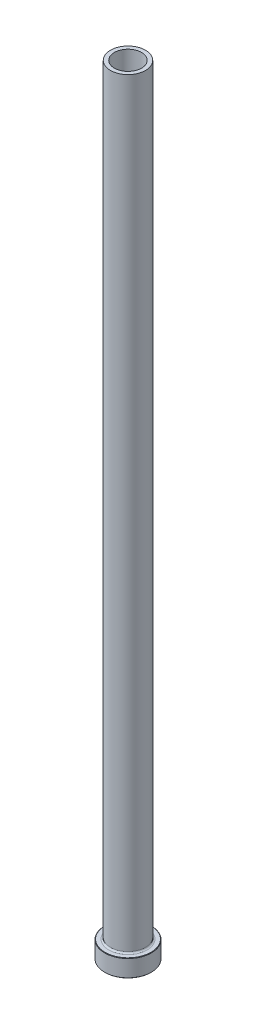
from build123d import *

# Parameters (mm, degrees)
FILLET1_R     = 0.8
CHAMFER1_SIZE = 0.2
CHAMFER3_SIZE = 0.5


with BuildPart() as part:
    # Sketch1 → Revolve1 (revolve)
    with BuildSketch(Plane.XY, mode=Mode.PRIVATE) as revolve1_sk:
        Polygon((-7, 400), (-9, 400), (-9, 9), (-12, 9), (-12, 0), (-7.25, 0), (-7.25, 333), (-7, 345), align=None)
    revolve(revolve1_sk.sketch.rotate(Axis((0, 92.187680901, 0), (0, -1, 0)), 270), axis=Axis((0, 92.187680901, 0), (0, -1, 0)))

    # Fillet1
    fillet1_edges = [part.edges().sort_by_distance(p)[0] for p in [
        (0, 9, -9),
    ]]
    fillet(fillet1_edges, radius=FILLET1_R)

    # Chamfer1
    chamfer1_edges = [part.edges().sort_by_distance(p)[0] for p in [
        (0, 0, -12),
        (0, 9, -12),
    ]]
    chamfer(chamfer1_edges, length=CHAMFER1_SIZE)

    # Chamfer3
    chamfer3_edges = [part.edges().sort_by_distance(p)[0] for p in [
        (0, 0, -7.25),
    ]]
    chamfer(chamfer3_edges, length=CHAMFER3_SIZE)


solid = part.part
